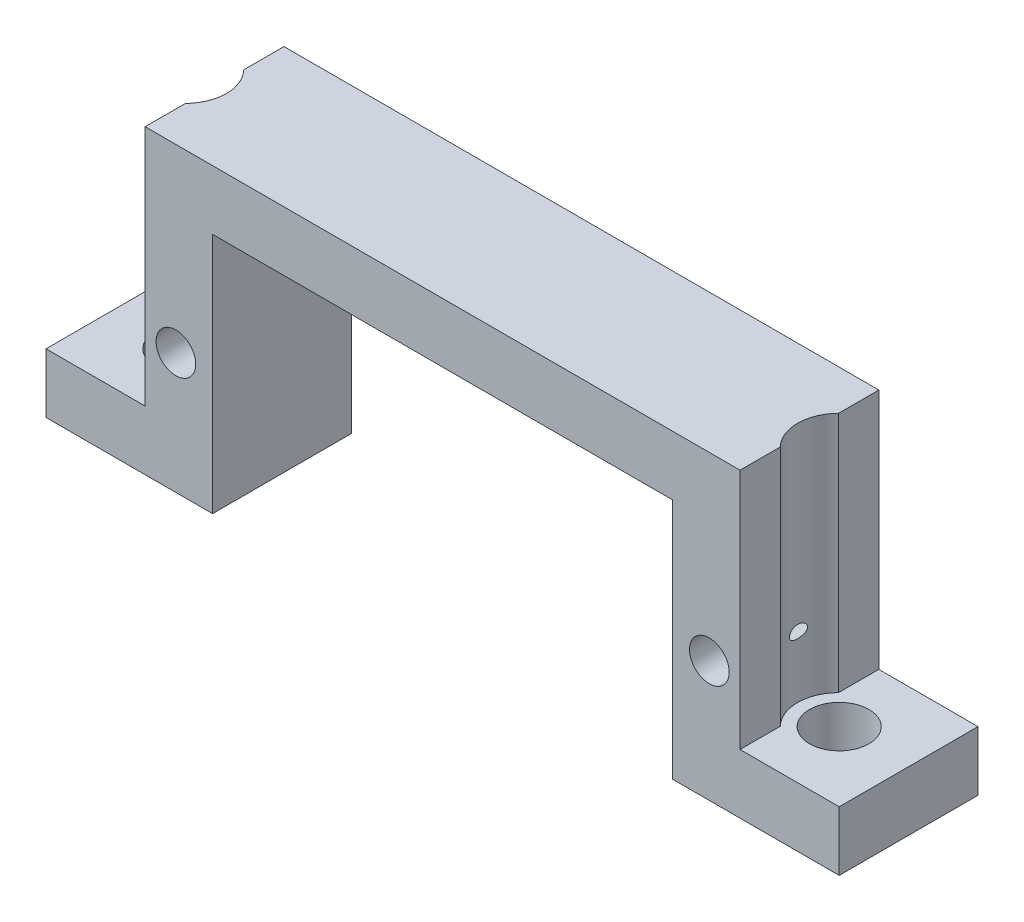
from build123d import *

# Parameters (mm, degrees)
ESQUISSE1_R             = 1
BOSS_EXTRU_1_DEPTH      = 7
ESQUISSE2_R             = 1.5
ENL_V_MAT_EXTRU_1_DEPTH = 3
ESQUISSE3_R             = 2.1
ENL_V_MAT_EXTRU_2_DEPTH = 12.2


with BuildPart() as part:
    # Esquisse1 → Boss.-Extru.1 (new body)
    with BuildSketch(Plane.XY):
        Polygon((11.6, 0), (20, 0), (20, 3), (15, 3), (15, 15.2), (-15, 15.2), (-15, 3), (-20, 3), (-20, 0), (-11.6, 0), (-11.6, 12.2), (11.6, 12.2), align=None)
        with Locations((13.45, 6.1)):
            Circle(ESQUISSE1_R, mode=Mode.SUBTRACT)
        with Locations(Location((-13.45, 6.1, 0), (0, 0, 180))):
            Circle(ESQUISSE1_R, mode=Mode.SUBTRACT)
    extrude(amount=BOSS_EXTRU_1_DEPTH)

    # Esquisse2 → Enl_v. mat.-Extru.1 (cut)
    with BuildSketch(Plane(origin=(0, 3, 0), x_dir=(1, 0, 0), z_dir=(0, 1, 0))):
        with Locations(Location((16.5, -3.5, 0), (0, 0, 180))):
            Circle(ESQUISSE2_R)
        with Locations((-16.5, -3.5)):
            Circle(ESQUISSE2_R)
    extrude(amount=-ENL_V_MAT_EXTRU_1_DEPTH, mode=Mode.SUBTRACT)

    # Esquisse3 → Enl_v. mat.-Extru.2 (cut)
    with BuildSketch(Plane(origin=(0, 15.2, 0), x_dir=(1, 0, 0), z_dir=(0, 1, 0))):
        with Locations((16.5, -3.5)):
            Circle(ESQUISSE3_R)
        with Locations((-16.5, -3.5)):
            Circle(ESQUISSE3_R)
    extrude(amount=-ENL_V_MAT_EXTRU_2_DEPTH, mode=Mode.SUBTRACT)


solid = part.part
